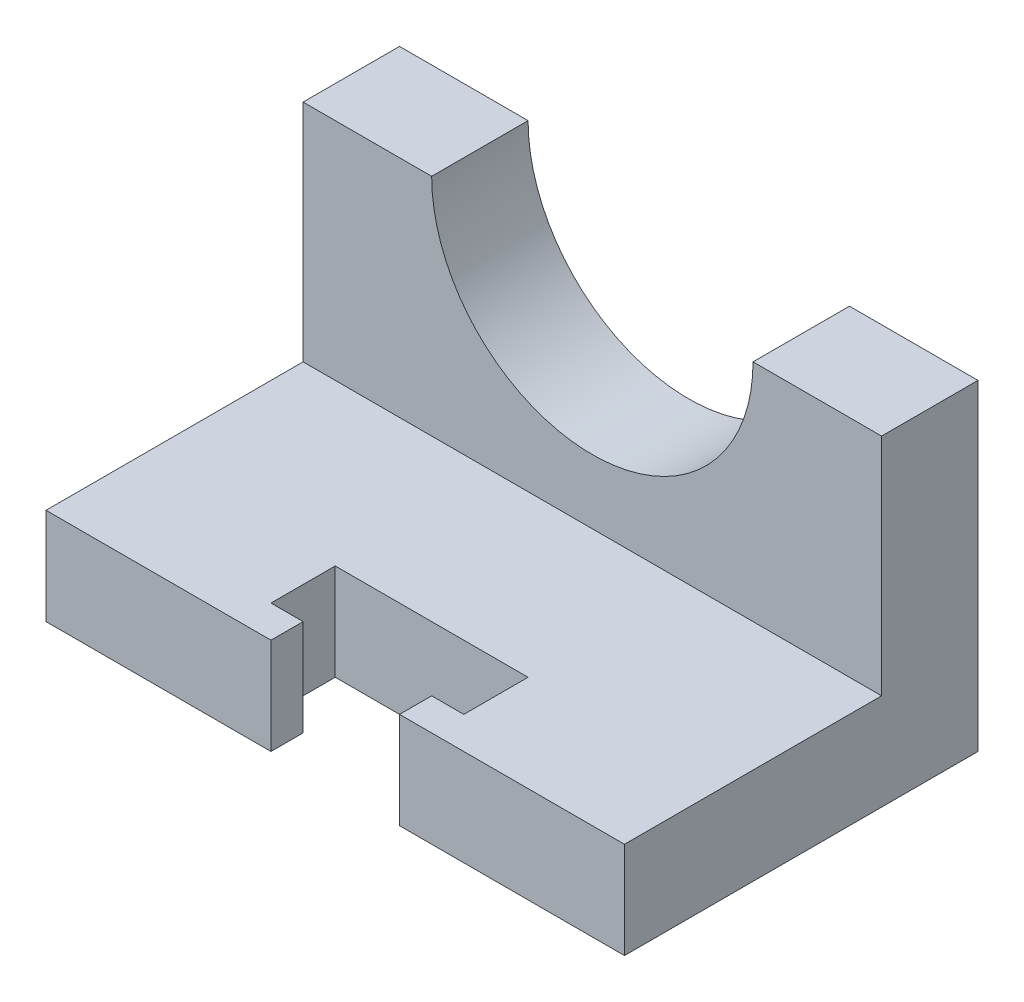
from build123d import *

# Parameters (mm, degrees)
SKETCH_2_W          = 90
SKETCH_2_H          = 55
EXTRUDE_1_DEPTH     = 50
SKETCH_3_W          = 40
SKETCH_3_H          = 35
CUT_EXTRUDE_1_DEPTH = 117.726175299
SKETCH_4_R          = 25
CUT_EXTRUDE_2_DEPTH = 111.453610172
CUT_EXTRUDE_3_DEPTH = 112.130553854


with BuildPart() as part:
    # Sketch 2 → Extrude 1 (new body)
    with BuildSketch(Plane(origin=(0, 0, 0), x_dir=(1, 0, 0), z_dir=(0, 1, 0))):
        with Locations((45, 27.5)):
            Rectangle(SKETCH_2_W, SKETCH_2_H)
    extrude(amount=EXTRUDE_1_DEPTH)

    # Sketch 3 → Cut-Extrude 1 (cut, through all)
    with BuildSketch(Plane(origin=(90, 0, 0), x_dir=(0, 0, -1), z_dir=(1, 0, 0))):
        with Locations((20, 32.5)):
            Rectangle(SKETCH_3_W, SKETCH_3_H)
    extrude(amount=-CUT_EXTRUDE_1_DEPTH, mode=Mode.SUBTRACT)

    # Sketch 4 → Cut-Extrude 2 (cut, through all)
    with BuildSketch(Plane.XY.offset(-40)):
        with Locations((45, 50)):
            Circle(SKETCH_4_R)
    extrude(amount=-CUT_EXTRUDE_2_DEPTH, mode=Mode.SUBTRACT)

    # Sketch 5 → Cut-Extrude 3 (cut, through all)
    with BuildSketch(Plane(origin=(0, 15, 0), x_dir=(1, 0, 0), z_dir=(0, 1, 0))):
        Polygon((55, 0), (35, 0), (35, 5), (30, 5), (30, 15), (60, 15), (60, 5), (55, 5), align=None)
    extrude(amount=-CUT_EXTRUDE_3_DEPTH, mode=Mode.SUBTRACT)


solid = part.part
